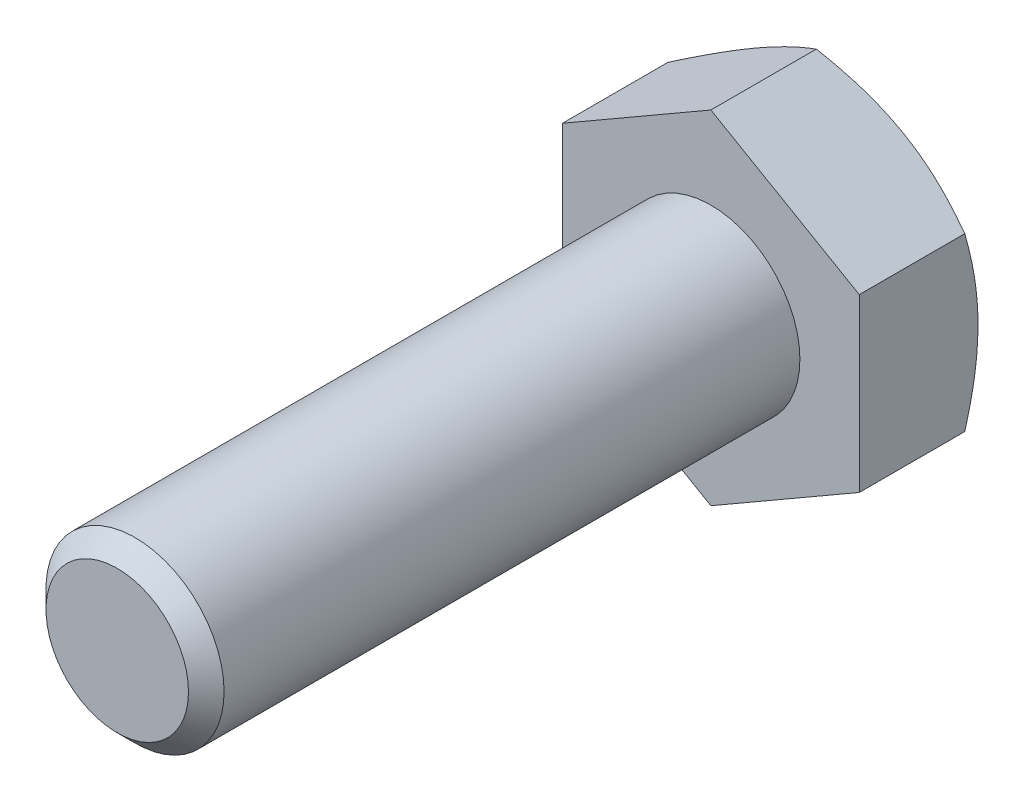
from build123d import *

# Parameters (mm, degrees)
ESQUISSE1_W        = 3
ESQUISSE1_H        = 20
CHANFREIN1_SIZE    = 0.6
BOSS_EXTRU_1_DEPTH = 4


with BuildPart() as part:
    # Esquisse1 → Base-R_volution (revolve)
    with BuildSketch(Plane(origin=(0, 0, 0), x_dir=(1, 0, 0), z_dir=(0, 1, 0))):
        with Locations((1.5, -10)):
            Rectangle(ESQUISSE1_W, ESQUISSE1_H)
    revolve(axis=Axis((0, 0, 0), (0, 0, 1)))

    # Chanfrein1
    chanfrein1_edges = [part.edges().sort_by_distance(p)[0] for p in [
        (-3, 0, 20),
    ]]
    chamfer(chanfrein1_edges, length=CHANFREIN1_SIZE)

    # Esquisse6 → Boss.-Extru.1 (add)
    with BuildSketch(Plane.XY):
        Polygon((5, -2.886751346), (5, 2.886751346), (0, 5.773502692), (-5, 2.886751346), (-5, -2.886751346), (0, -5.773502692), align=None)
    extrude(amount=-BOSS_EXTRU_1_DEPTH)

    # Esquisse7 → Enl_vement de mati_re-R_volution1 (revolve, cut)
    with BuildSketch(Plane(origin=(0, 0, 0), x_dir=(1, 0, 0), z_dir=(0, 1, 0))):
        Polygon((-5, 4), (-11.92820323, 4), (-11.92820323, 0), align=None)
    revolve(axis=Axis((0, 0, -6.239446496), (0, 0, 1)), mode=Mode.SUBTRACT)


solid = part.part
